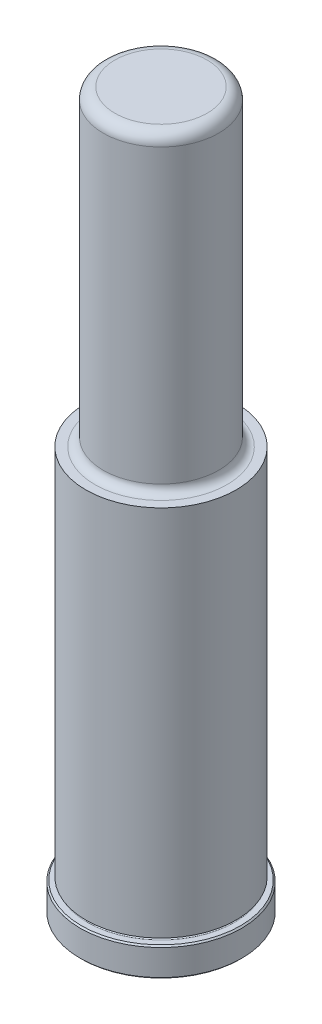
ISO-10303-21;
HEADER;
FILE_DESCRIPTION(('STEP AP214'),'2;1');
FILE_NAME('part.step','',(''),(''),'','','');
FILE_SCHEMA(('AUTOMOTIVE_DESIGN { 1 0 10303 214 1 1 1 1 }'));
ENDSEC;
DATA;
#1=APPLICATION_CONTEXT('core data for automotive mechanical design processes');
#2=APPLICATION_PROTOCOL_DEFINITION('international standard','automotive_design',2000,#1);
#3=PRODUCT_CONTEXT('',#1,'mechanical');
#4=PRODUCT('Part','Part','',(#3));
#5=PRODUCT_RELATED_PRODUCT_CATEGORY('part','',(#4));
#6=PRODUCT_DEFINITION_FORMATION('','',#4);
#7=PRODUCT_DEFINITION_CONTEXT('part definition',#1,'design');
#8=PRODUCT_DEFINITION('design','',#6,#7);
#9=PRODUCT_DEFINITION_SHAPE('','',#8);
#10=(LENGTH_UNIT() NAMED_UNIT(*) SI_UNIT(.MILLI.,.METRE.));
#11=(NAMED_UNIT(*) PLANE_ANGLE_UNIT() SI_UNIT($,.RADIAN.));
#12=(NAMED_UNIT(*) SI_UNIT($,.STERADIAN.) SOLID_ANGLE_UNIT());
#13=UNCERTAINTY_MEASURE_WITH_UNIT(LENGTH_MEASURE(1.E-05),#10,'distance_accuracy_value','');
#14=(GEOMETRIC_REPRESENTATION_CONTEXT(3) GLOBAL_UNCERTAINTY_ASSIGNED_CONTEXT((#13)) GLOBAL_UNIT_ASSIGNED_CONTEXT((#10,
#11,#12)) REPRESENTATION_CONTEXT('',''));
#15=CARTESIAN_POINT('',(0.,0.,0.));
#16=DIRECTION('',(0.,0.,1.));
#17=DIRECTION('',(1.,0.,0.));
#18=AXIS2_PLACEMENT_3D('',#15,#16,#17);
#19=CARTESIAN_POINT('',(0.,0.,0.));
#20=DIRECTION('',(0.,1.,0.));
#21=DIRECTION('',(0.,0.,1.));
#22=AXIS2_PLACEMENT_3D('',#19,#20,#21);
#23=PLANE('',#22);
#24=CARTESIAN_POINT('',(0.,0.,0.));
#25=DIRECTION('',(0.,1.,0.));
#26=DIRECTION('',(0.,0.,1.));
#27=AXIS2_PLACEMENT_3D('',#24,#25,#26);
#28=CIRCLE('',#27,21.844);
#29=CARTESIAN_POINT('',(0.,0.,21.844));
#30=VERTEX_POINT('',#29);
#31=EDGE_CURVE('E46',#30,#30,#28,.F.);
#32=ORIENTED_EDGE('',*,*,#31,.T.);
#33=EDGE_LOOP('',(#32));
#34=FACE_BOUND('',#33,.T.);
#35=ADVANCED_FACE('F31',(#34),#23,.F.);
#36=CARTESIAN_POINT('',(0.,0.,0.));
#37=DIRECTION('',(0.,1.,0.));
#38=DIRECTION('',(0.,0.,1.));
#39=AXIS2_PLACEMENT_3D('',#36,#37,#38);
#40=CYLINDRICAL_SURFACE('',#39,22.225);
#41=CARTESIAN_POINT('',(0.,0.380999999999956,0.));
#42=DIRECTION('',(0.,1.,0.));
#43=DIRECTION('',(0.,0.,1.));
#44=AXIS2_PLACEMENT_3D('',#41,#42,#43);
#45=CIRCLE('',#44,22.225);
#46=CARTESIAN_POINT('',(0.,0.380999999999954,22.225));
#47=VERTEX_POINT('',#46);
#48=EDGE_CURVE('E51',#47,#47,#45,.T.);
#49=ORIENTED_EDGE('',*,*,#48,.T.);
#50=EDGE_LOOP('',(#49));
#51=FACE_BOUND('',#50,.T.);
#52=CARTESIAN_POINT('',(0.,7.54379999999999,0.));
#53=DIRECTION('',(0.,-1.,0.));
#54=DIRECTION('',(0.,0.,-1.));
#55=AXIS2_PLACEMENT_3D('',#52,#53,#54);
#56=CIRCLE('',#55,22.225);
#57=CARTESIAN_POINT('',(0.,7.5438,-22.225));
#58=VERTEX_POINT('',#57);
#59=EDGE_CURVE('E54',#58,#58,#56,.T.);
#60=ORIENTED_EDGE('',*,*,#59,.T.);
#61=EDGE_LOOP('',(#60));
#62=FACE_BOUND('',#61,.T.);
#63=ADVANCED_FACE('F110',(#51,#62),#40,.T.);
#64=CARTESIAN_POINT('',(0.,7.9248,-22.225));
#65=DIRECTION('',(0.,-1.,0.));
#66=DIRECTION('',(0.,0.,-1.));
#67=AXIS2_PLACEMENT_3D('',#64,#65,#66);
#68=PLANE('',#67);
#69=CARTESIAN_POINT('',(0.,7.9248,0.));
#70=DIRECTION('',(0.,-1.,0.));
#71=DIRECTION('',(0.,0.,-1.));
#72=AXIS2_PLACEMENT_3D('',#69,#70,#71);
#73=CIRCLE('',#72,21.844);
#74=CARTESIAN_POINT('',(0.,7.9248,-21.844));
#75=VERTEX_POINT('',#74);
#76=EDGE_CURVE('E42',#75,#75,#73,.F.);
#77=ORIENTED_EDGE('',*,*,#76,.T.);
#78=EDGE_LOOP('',(#77));
#79=FACE_BOUND('',#78,.T.);
#80=CARTESIAN_POINT('',(0.,7.9248,0.));
#81=DIRECTION('',(0.,1.,0.));
#82=DIRECTION('',(0.,0.,1.));
#83=AXIS2_PLACEMENT_3D('',#80,#81,#82);
#84=CIRCLE('',#83,20.2438);
#85=CARTESIAN_POINT('',(0.,7.92479999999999,20.2438));
#86=VERTEX_POINT('',#85);
#87=EDGE_CURVE('E57',#86,#86,#84,.T.);
#88=ORIENTED_EDGE('',*,*,#87,.F.);
#89=EDGE_LOOP('',(#88));
#90=FACE_BOUND('',#89,.T.);
#91=ADVANCED_FACE('F105',(#79,#90),#68,.F.);
#92=CARTESIAN_POINT('',(0.,8.3058,0.));
#93=DIRECTION('',(0.,1.,0.));
#94=DIRECTION('',(0.,0.,1.));
#95=AXIS2_PLACEMENT_3D('',#92,#93,#94);
#96=TOROIDAL_SURFACE('',#95,20.2438,0.380999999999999);
#97=CARTESIAN_POINT('',(0.,8.6868,0.));
#98=DIRECTION('',(0.,1.,0.));
#99=DIRECTION('',(0.,0.,1.));
#100=AXIS2_PLACEMENT_3D('',#97,#98,#99);
#101=CIRCLE('',#100,20.2438);
#102=CARTESIAN_POINT('',(0.,8.68679999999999,20.2438));
#103=VERTEX_POINT('',#102);
#104=EDGE_CURVE('E60',#103,#103,#101,.T.);
#105=ORIENTED_EDGE('',*,*,#104,.F.);
#106=EDGE_LOOP('',(#105));
#107=FACE_BOUND('',#106,.T.);
#108=ORIENTED_EDGE('',*,*,#87,.T.);
#109=EDGE_LOOP('',(#108));
#110=FACE_BOUND('',#109,.T.);
#111=ADVANCED_FACE('F99',(#107,#110),#96,.F.);
#112=CARTESIAN_POINT('',(0.,8.6868,-20.2438));
#113=DIRECTION('',(0.,1.,0.));
#114=DIRECTION('',(0.,0.,1.));
#115=AXIS2_PLACEMENT_3D('',#112,#113,#114);
#116=PLANE('',#115);
#117=CARTESIAN_POINT('',(0.,8.6868,0.));
#118=DIRECTION('',(0.,1.,0.));
#119=DIRECTION('',(0.,0.,1.));
#120=AXIS2_PLACEMENT_3D('',#117,#118,#119);
#121=CIRCLE('',#120,20.6502);
#122=CARTESIAN_POINT('',(0.,8.6868,20.6502));
#123=VERTEX_POINT('',#122);
#124=EDGE_CURVE('E63',#123,#123,#121,.T.);
#125=ORIENTED_EDGE('',*,*,#124,.F.);
#126=EDGE_LOOP('',(#125));
#127=FACE_BOUND('',#126,.T.);
#128=ORIENTED_EDGE('',*,*,#104,.T.);
#129=EDGE_LOOP('',(#128));
#130=FACE_BOUND('',#129,.T.);
#131=ADVANCED_FACE('F93',(#127,#130),#116,.F.);
#132=CARTESIAN_POINT('',(0.,0.,0.));
#133=DIRECTION('',(0.,1.,0.));
#134=DIRECTION('',(0.,0.,1.));
#135=AXIS2_PLACEMENT_3D('',#132,#133,#134);
#136=CYLINDRICAL_SURFACE('',#135,20.6502);
#137=CARTESIAN_POINT('',(0.,111.125,0.));
#138=DIRECTION('',(0.,1.,0.));
#139=DIRECTION('',(0.,0.,1.));
#140=AXIS2_PLACEMENT_3D('',#137,#138,#139);
#141=CIRCLE('',#140,20.6502);
#142=CARTESIAN_POINT('',(0.,111.125,20.6502));
#143=VERTEX_POINT('',#142);
#144=EDGE_CURVE('E66',#143,#143,#141,.T.);
#145=ORIENTED_EDGE('',*,*,#144,.F.);
#146=EDGE_LOOP('',(#145));
#147=FACE_BOUND('',#146,.T.);
#148=ORIENTED_EDGE('',*,*,#124,.T.);
#149=EDGE_LOOP('',(#148));
#150=FACE_BOUND('',#149,.T.);
#151=ADVANCED_FACE('F87',(#147,#150),#136,.T.);
#152=CARTESIAN_POINT('',(0.,111.125,-20.6502));
#153=DIRECTION('',(0.,-1.,0.));
#154=DIRECTION('',(0.,0.,-1.));
#155=AXIS2_PLACEMENT_3D('',#152,#153,#154);
#156=PLANE('',#155);
#157=CARTESIAN_POINT('',(0.,111.125,0.));
#158=DIRECTION('',(0.,1.,0.));
#159=DIRECTION('',(0.,0.,1.));
#160=AXIS2_PLACEMENT_3D('',#157,#158,#159);
#161=CIRCLE('',#160,18.1483);
#162=CARTESIAN_POINT('',(0.,111.125,18.1483));
#163=VERTEX_POINT('',#162);
#164=EDGE_CURVE('E69',#163,#163,#161,.T.);
#165=ORIENTED_EDGE('',*,*,#164,.F.);
#166=EDGE_LOOP('',(#165));
#167=FACE_BOUND('',#166,.T.);
#168=ORIENTED_EDGE('',*,*,#144,.T.);
#169=EDGE_LOOP('',(#168));
#170=FACE_BOUND('',#169,.T.);
#171=ADVANCED_FACE('F81',(#167,#170),#156,.F.);
#172=CARTESIAN_POINT('',(0.,113.411,0.));
#173=DIRECTION('',(0.,1.,0.));
#174=DIRECTION('',(0.,0.,1.));
#175=AXIS2_PLACEMENT_3D('',#172,#173,#174);
#176=TOROIDAL_SURFACE('',#175,18.1483,2.286);
#177=CARTESIAN_POINT('',(0.,113.411,0.));
#178=DIRECTION('',(0.,1.,0.));
#179=DIRECTION('',(0.,0.,1.));
#180=AXIS2_PLACEMENT_3D('',#177,#178,#179);
#181=CIRCLE('',#180,15.8623);
#182=CARTESIAN_POINT('',(0.,113.411,15.8623));
#183=VERTEX_POINT('',#182);
#184=EDGE_CURVE('E72',#183,#183,#181,.T.);
#185=ORIENTED_EDGE('',*,*,#184,.F.);
#186=EDGE_LOOP('',(#185));
#187=FACE_BOUND('',#186,.T.);
#188=ORIENTED_EDGE('',*,*,#164,.T.);
#189=EDGE_LOOP('',(#188));
#190=FACE_BOUND('',#189,.T.);
#191=ADVANCED_FACE('F78',(#187,#190),#176,.F.);
#192=CARTESIAN_POINT('',(0.,0.,0.));
#193=DIRECTION('',(0.,1.,0.));
#194=DIRECTION('',(0.,0.,1.));
#195=AXIS2_PLACEMENT_3D('',#192,#193,#194);
#196=CYLINDRICAL_SURFACE('',#195,15.8623);
#197=CARTESIAN_POINT('',(0.,193.675,0.));
#198=DIRECTION('',(0.,-1.,0.));
#199=DIRECTION('',(0.,0.,-1.));
#200=AXIS2_PLACEMENT_3D('',#197,#198,#199);
#201=CIRCLE('',#200,15.8623);
#202=CARTESIAN_POINT('',(0.,193.675,-15.8623));
#203=VERTEX_POINT('',#202);
#204=EDGE_CURVE('E10',#203,#203,#201,.T.);
#205=ORIENTED_EDGE('',*,*,#204,.T.);
#206=EDGE_LOOP('',(#205));
#207=FACE_BOUND('',#206,.T.);
#208=ORIENTED_EDGE('',*,*,#184,.T.);
#209=EDGE_LOOP('',(#208));
#210=FACE_BOUND('',#209,.T.);
#211=ADVANCED_FACE('F76',(#207,#210),#196,.T.);
#212=CARTESIAN_POINT('',(0.,196.85,-15.8623));
#213=DIRECTION('',(0.,-1.,0.));
#214=DIRECTION('',(0.,0.,-1.));
#215=AXIS2_PLACEMENT_3D('',#212,#213,#214);
#216=PLANE('',#215);
#217=CARTESIAN_POINT('',(0.,196.85,0.));
#218=DIRECTION('',(0.,-1.,0.));
#219=DIRECTION('',(0.,0.,-1.));
#220=AXIS2_PLACEMENT_3D('',#217,#218,#219);
#221=CIRCLE('',#220,12.6873);
#222=CARTESIAN_POINT('',(0.,196.85,-12.6873));
#223=VERTEX_POINT('',#222);
#224=EDGE_CURVE('E38',#223,#223,#221,.F.);
#225=ORIENTED_EDGE('',*,*,#224,.T.);
#226=EDGE_LOOP('',(#225));
#227=FACE_BOUND('',#226,.T.);
#228=ADVANCED_FACE('F127',(#227),#216,.F.);
#229=CARTESIAN_POINT('',(0.,0.380999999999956,0.));
#230=DIRECTION('',(0.,1.,0.));
#231=DIRECTION('',(0.,0.,1.));
#232=AXIS2_PLACEMENT_3D('',#229,#230,#231);
#233=CONICAL_SURFACE('',#232,22.225,0.785398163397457);
#234=ORIENTED_EDGE('',*,*,#31,.F.);
#235=EDGE_LOOP('',(#234));
#236=FACE_BOUND('',#235,.T.);
#237=ORIENTED_EDGE('',*,*,#48,.F.);
#238=EDGE_LOOP('',(#237));
#239=FACE_BOUND('',#238,.T.);
#240=ADVANCED_FACE('F124',(#236,#239),#233,.T.);
#241=CARTESIAN_POINT('',(0.,7.9248,0.));
#242=DIRECTION('',(0.,-1.,0.));
#243=DIRECTION('',(0.,0.,-1.));
#244=AXIS2_PLACEMENT_3D('',#241,#242,#243);
#245=CONICAL_SURFACE('',#244,21.844,0.785398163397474);
#246=ORIENTED_EDGE('',*,*,#59,.F.);
#247=EDGE_LOOP('',(#246));
#248=FACE_BOUND('',#247,.T.);
#249=ORIENTED_EDGE('',*,*,#76,.F.);
#250=EDGE_LOOP('',(#249));
#251=FACE_BOUND('',#250,.T.);
#252=ADVANCED_FACE('F126',(#248,#251),#245,.T.);
#253=CARTESIAN_POINT('',(0.,193.675,0.));
#254=DIRECTION('',(0.,-1.,0.));
#255=DIRECTION('',(0.,0.,-1.));
#256=AXIS2_PLACEMENT_3D('',#253,#254,#255);
#257=TOROIDAL_SURFACE('',#256,12.6873,3.175);
#258=ORIENTED_EDGE('',*,*,#204,.F.);
#259=EDGE_LOOP('',(#258));
#260=FACE_BOUND('',#259,.T.);
#261=ORIENTED_EDGE('',*,*,#224,.F.);
#262=EDGE_LOOP('',(#261));
#263=FACE_BOUND('',#262,.T.);
#264=ADVANCED_FACE('F33',(#260,#263),#257,.T.);
#265=CLOSED_SHELL('',(#35,#63,#91,#111,#131,#151,#171,#191,#211,#228,#240,#252,#264));
#266=MANIFOLD_SOLID_BREP('B2',#265);
#267=ADVANCED_BREP_SHAPE_REPRESENTATION('',(#18,#266),#14);
#268=SHAPE_DEFINITION_REPRESENTATION(#9,#267);
ENDSEC;
END-ISO-10303-21;
